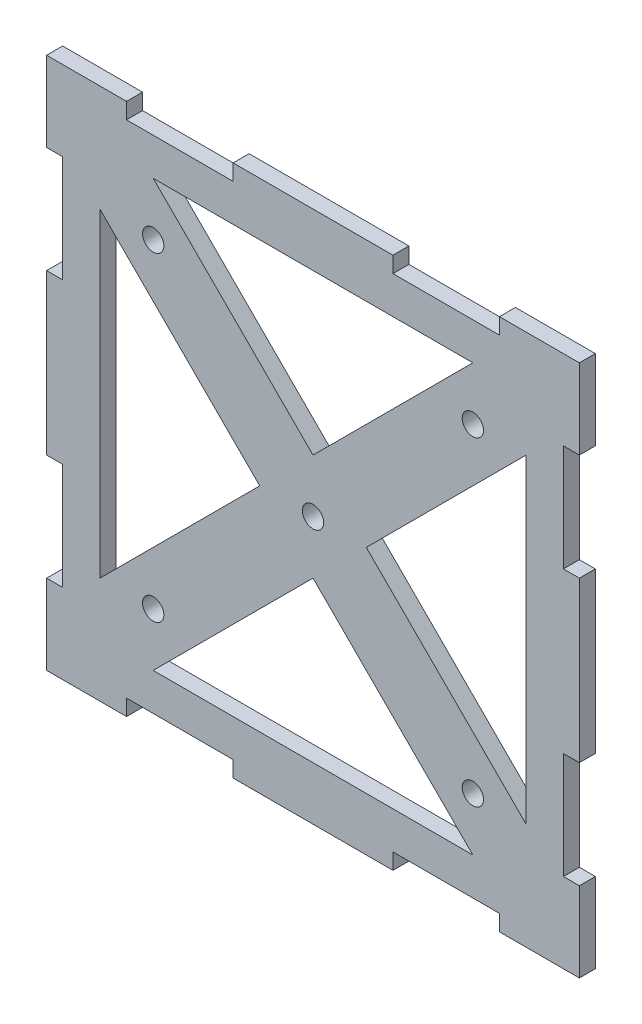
from build123d import *

# Parameters (mm, degrees)
ESQUISSE1_W             = 100
ESQUISSE1_H             = 100
ESQUISSE1_W_2           = 80
ESQUISSE1_H_2           = 80
ESQUISSE1_R             = 2
BOSS_EXTRU_1_DEPTH      = 3
ENL_V_MAT_EXTRU_1_REACH = 136.769
ESQUISSE2_W             = 3
ESQUISSE2_H             = 20
ESQUISSE2_W_2           = 20
ESQUISSE2_H_2           = 3


with BuildPart() as part:
    # Esquisse1 → Boss.-Extru.1 (new body)
    # profile 1 of 2: a face of its own
    with BuildSketch(Plane.XY):
        with Locations((-36.351443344, 53.427454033)):
            Rectangle(ESQUISSE1_W, ESQUISSE1_H)
        with Locations((-36.351443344, 53.427454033)):
            Rectangle(ESQUISSE1_W_2, ESQUISSE1_H_2, mode=Mode.SUBTRACT)
    # profile 2 of 2: a face of its own
    with BuildSketch(Plane.XY):
        Polygon((-66.351443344, 93.427454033), (-76.351443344, 93.427454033), (-76.351443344, 83.427454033), (-46.351443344, 53.427454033), (-76.351443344, 23.427454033), (-76.351443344, 13.427454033), (-66.351443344, 13.427454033), (-36.351443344, 43.427454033), (-6.351443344, 13.427454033), (3.648556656, 13.427454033), (3.648556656, 23.427454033), (-26.351443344, 53.427454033), (3.648556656, 83.427454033), (3.648556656, 93.427454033), (-6.351443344, 93.427454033), (-36.351443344, 63.427454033), align=None)
        with Locations((-66.351443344, 23.427454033)):
            Circle(ESQUISSE1_R, mode=Mode.SUBTRACT)
        with Locations((-6.351443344, 23.427454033)):
            Circle(ESQUISSE1_R, mode=Mode.SUBTRACT)
        with Locations((-36.351443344, 53.427454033)):
            Circle(ESQUISSE1_R, mode=Mode.SUBTRACT)
        with Locations((-66.351443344, 83.427454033)):
            Circle(ESQUISSE1_R, mode=Mode.SUBTRACT)
        with Locations((-6.351443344, 83.427454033)):
            Circle(ESQUISSE1_R, mode=Mode.SUBTRACT)
    extrude(amount=BOSS_EXTRU_1_DEPTH)

    # Esquisse2 → Enl_v. mat.-Extru.1 (cut, up to next)
    with BuildSketch(Plane.XY.offset(3), mode=Mode.PRIVATE) as enl_v_mat_extru_1_sk1:
        with Locations((-84.851443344, 28.427454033)):
            Rectangle(ESQUISSE2_W, ESQUISSE2_H)
    enl_v_mat_extru_1_tool1 = extrude(enl_v_mat_extru_1_sk1.sketch, amount=-ENL_V_MAT_EXTRU_1_REACH, mode=Mode.PRIVATE) & part.part
    # Esquisse2 → Enl_v. mat.-Extru.1 (cut, up to next)
    with BuildSketch(Plane.XY.offset(3), mode=Mode.PRIVATE) as enl_v_mat_extru_1_sk2:
        with Locations((-61.351443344, 101.927454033)):
            Rectangle(ESQUISSE2_W_2, ESQUISSE2_H_2)
    enl_v_mat_extru_1_tool2 = extrude(enl_v_mat_extru_1_sk2.sketch, amount=-ENL_V_MAT_EXTRU_1_REACH, mode=Mode.PRIVATE) & part.part
    # Esquisse2 → Enl_v. mat.-Extru.1 (cut, up to next)
    with BuildSketch(Plane.XY.offset(3), mode=Mode.PRIVATE) as enl_v_mat_extru_1_sk3:
        with Locations((-84.851443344, 78.427454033)):
            Rectangle(ESQUISSE2_W, ESQUISSE2_H)
    enl_v_mat_extru_1_tool3 = extrude(enl_v_mat_extru_1_sk3.sketch, amount=-ENL_V_MAT_EXTRU_1_REACH, mode=Mode.PRIVATE) & part.part
    # Esquisse2 → Enl_v. mat.-Extru.1 (cut, up to next)
    with BuildSketch(Plane.XY.offset(3), mode=Mode.PRIVATE) as enl_v_mat_extru_1_sk4:
        with Locations((-61.351443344, 4.927454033)):
            Rectangle(ESQUISSE2_W_2, ESQUISSE2_H_2)
    enl_v_mat_extru_1_tool4 = extrude(enl_v_mat_extru_1_sk4.sketch, amount=-ENL_V_MAT_EXTRU_1_REACH, mode=Mode.PRIVATE) & part.part
    # Esquisse2 → Enl_v. mat.-Extru.1 (cut, up to next)
    with BuildSketch(Plane.XY.offset(3), mode=Mode.PRIVATE) as enl_v_mat_extru_1_sk5:
        with Locations((-11.351443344, 4.927454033)):
            Rectangle(ESQUISSE2_W_2, ESQUISSE2_H_2)
    enl_v_mat_extru_1_tool5 = extrude(enl_v_mat_extru_1_sk5.sketch, amount=-ENL_V_MAT_EXTRU_1_REACH, mode=Mode.PRIVATE) & part.part
    # Esquisse2 → Enl_v. mat.-Extru.1 (cut, up to next)
    with BuildSketch(Plane.XY.offset(3), mode=Mode.PRIVATE) as enl_v_mat_extru_1_sk6:
        with Locations((12.148556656, 28.427454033)):
            Rectangle(ESQUISSE2_W, ESQUISSE2_H)
    enl_v_mat_extru_1_tool6 = extrude(enl_v_mat_extru_1_sk6.sketch, amount=-ENL_V_MAT_EXTRU_1_REACH, mode=Mode.PRIVATE) & part.part
    # Esquisse2 → Enl_v. mat.-Extru.1 (cut, up to next)
    with BuildSketch(Plane.XY.offset(3), mode=Mode.PRIVATE) as enl_v_mat_extru_1_sk7:
        with Locations((12.148556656, 78.427454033)):
            Rectangle(ESQUISSE2_W, ESQUISSE2_H)
    enl_v_mat_extru_1_tool7 = extrude(enl_v_mat_extru_1_sk7.sketch, amount=-ENL_V_MAT_EXTRU_1_REACH, mode=Mode.PRIVATE) & part.part
    # Esquisse2 → Enl_v. mat.-Extru.1 (cut, up to next)
    with BuildSketch(Plane.XY.offset(3), mode=Mode.PRIVATE) as enl_v_mat_extru_1_sk8:
        with Locations((-11.351443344, 101.927454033)):
            Rectangle(ESQUISSE2_W_2, ESQUISSE2_H_2)
    enl_v_mat_extru_1_tool8 = extrude(enl_v_mat_extru_1_sk8.sketch, amount=-ENL_V_MAT_EXTRU_1_REACH, mode=Mode.PRIVATE) & part.part
    add(enl_v_mat_extru_1_tool1.solids().sort_by_distance((-84.851443, 28.427454, 3))[0], mode=Mode.SUBTRACT)
    add(enl_v_mat_extru_1_tool2.solids().sort_by_distance((-61.351443, 101.927454, 3))[0], mode=Mode.SUBTRACT)
    add(enl_v_mat_extru_1_tool3.solids().sort_by_distance((-84.851443, 78.427454, 3))[0], mode=Mode.SUBTRACT)
    add(enl_v_mat_extru_1_tool4.solids().sort_by_distance((-61.351443, 4.927454, 3))[0], mode=Mode.SUBTRACT)
    add(enl_v_mat_extru_1_tool5.solids().sort_by_distance((-11.351443, 4.927454, 3))[0], mode=Mode.SUBTRACT)
    add(enl_v_mat_extru_1_tool6.solids().sort_by_distance((12.148557, 28.427454, 3))[0], mode=Mode.SUBTRACT)
    add(enl_v_mat_extru_1_tool7.solids().sort_by_distance((12.148557, 78.427454, 3))[0], mode=Mode.SUBTRACT)
    add(enl_v_mat_extru_1_tool8.solids().sort_by_distance((-11.351443, 101.927454, 3))[0], mode=Mode.SUBTRACT)


solid = part.part
